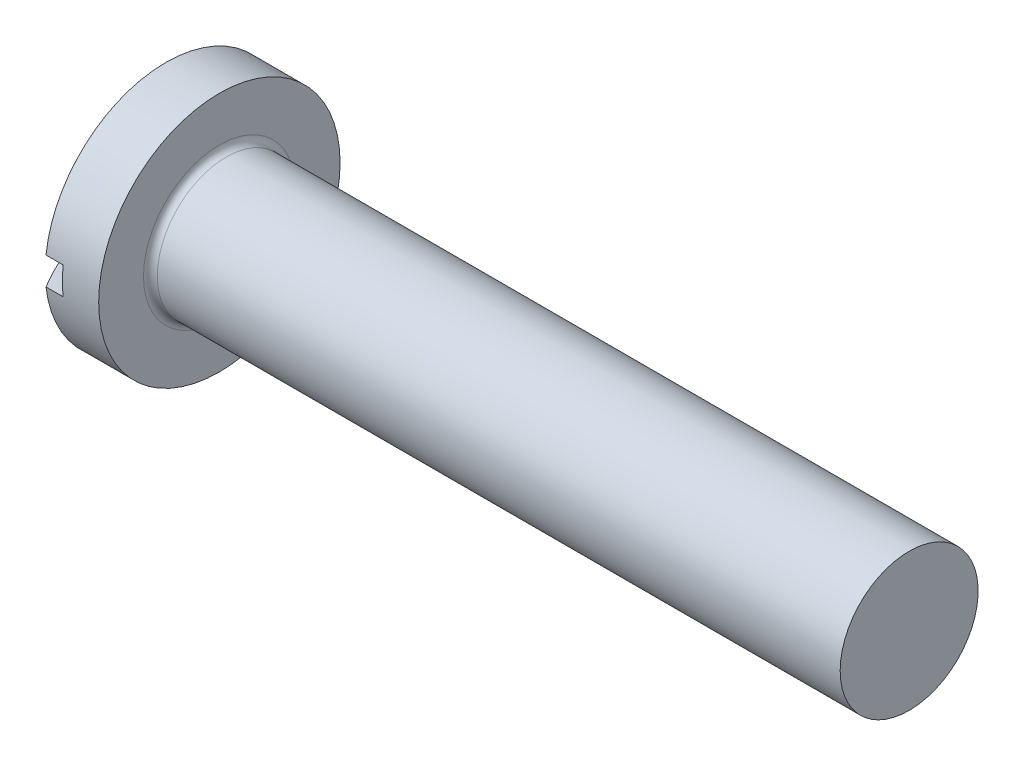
from build123d import *

# Parameters (mm, degrees)
FILLET1_R  = 0.4
SLOTSKE_W  = 14
SLOTSKE_H  = 1.6
SLOT_DEPTH = 3


with BuildPart() as part:
    # BodySke → BaseBody (revolve)
    with BuildSketch(Plane.XY, mode=Mode.PRIVATE) as basebody_sk:
        with BuildLine():
            Line((5.1, 7), (5.1, 4))
            Line((5.1, 4), (45.1, 4))
            Line((45.1, 4), (45.1, 0))
            Line((45.1, 0), (0, 0))
            ThreePointArc((0, 0), (0.509807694, 3.640054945), (2, 7))
            Line((2, 7), (5.1, 7))
        make_face()
    revolve(basebody_sk.sketch.rotate(Axis((0, 0, 0), (1, 0, 0)), 90), axis=Axis((0, 0, 0), (1, 0, 0)))

    # Fillet1
    fillet1_edges = [part.edges().sort_by_distance(p)[0] for p in [
        (5.1, 0, -4),
    ]]
    fillet(fillet1_edges, radius=FILLET1_R)

    # SlotSke → Slot (cut)
    with BuildSketch(Plane(origin=(0, 0, 0), x_dir=(0, 0, -1), z_dir=(1, 0, 0))):
        Rectangle(SLOTSKE_W, SLOTSKE_H)
    extrude(amount=SLOT_DEPTH, mode=Mode.SUBTRACT)


solid = part.part
